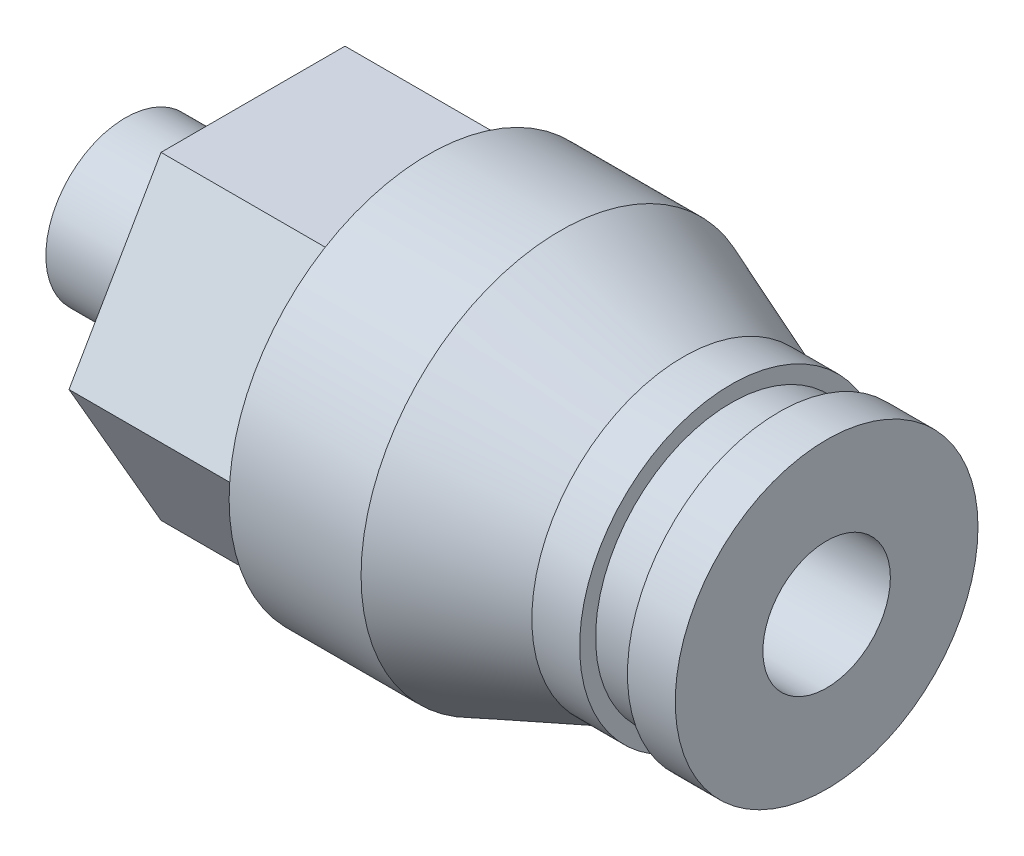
ISO-10303-21;
HEADER;
FILE_DESCRIPTION(('STEP AP214'),'2;1');
FILE_NAME('part.step','',(''),(''),'','','');
FILE_SCHEMA(('AUTOMOTIVE_DESIGN { 1 0 10303 214 1 1 1 1 }'));
ENDSEC;
DATA;
#1=APPLICATION_CONTEXT('core data for automotive mechanical design processes');
#2=APPLICATION_PROTOCOL_DEFINITION('international standard','automotive_design',2000,#1);
#3=PRODUCT_CONTEXT('',#1,'mechanical');
#4=PRODUCT('Part','Part','',(#3));
#5=PRODUCT_RELATED_PRODUCT_CATEGORY('part','',(#4));
#6=PRODUCT_DEFINITION_FORMATION('','',#4);
#7=PRODUCT_DEFINITION_CONTEXT('part definition',#1,'design');
#8=PRODUCT_DEFINITION('design','',#6,#7);
#9=PRODUCT_DEFINITION_SHAPE('','',#8);
#10=(LENGTH_UNIT() NAMED_UNIT(*) SI_UNIT(.MILLI.,.METRE.));
#11=(NAMED_UNIT(*) PLANE_ANGLE_UNIT() SI_UNIT($,.RADIAN.));
#12=(NAMED_UNIT(*) SI_UNIT($,.STERADIAN.) SOLID_ANGLE_UNIT());
#13=UNCERTAINTY_MEASURE_WITH_UNIT(LENGTH_MEASURE(1.E-05),#10,'distance_accuracy_value','');
#14=(GEOMETRIC_REPRESENTATION_CONTEXT(3) GLOBAL_UNCERTAINTY_ASSIGNED_CONTEXT((#13)) GLOBAL_UNIT_ASSIGNED_CONTEXT((#10,
#11,#12)) REPRESENTATION_CONTEXT('',''));
#15=CARTESIAN_POINT('',(0.,0.,0.));
#16=DIRECTION('',(0.,0.,1.));
#17=DIRECTION('',(1.,0.,0.));
#18=AXIS2_PLACEMENT_3D('',#15,#16,#17);
#19=CARTESIAN_POINT('',(4.,2.5,0.));
#20=DIRECTION('',(-1.,0.,0.));
#21=DIRECTION('',(0.,0.,1.));
#22=AXIS2_PLACEMENT_3D('',#19,#20,#21);
#23=PLANE('',#22);
#24=CARTESIAN_POINT('',(4.,0.,0.));
#25=DIRECTION('',(1.,0.,0.));
#26=DIRECTION('',(0.,0.,-1.));
#27=AXIS2_PLACEMENT_3D('',#24,#25,#26);
#28=CIRCLE('',#27,2.5);
#29=CARTESIAN_POINT('',(4.,0.,-2.5));
#30=VERTEX_POINT('',#29);
#31=EDGE_CURVE('E220',#30,#30,#28,.T.);
#32=ORIENTED_EDGE('',*,*,#31,.T.);
#33=EDGE_LOOP('',(#32));
#34=FACE_BOUND('',#33,.T.);
#35=DIRECTION('',(0.,-0.866025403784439,0.5));
#36=VECTOR('',#35,1.);
#37=CARTESIAN_POINT('',(4.,0.,-5.77350269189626));
#38=LINE('',#37,#36);
#39=CARTESIAN_POINT('',(4.,0.,-5.77350269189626));
#40=VERTEX_POINT('',#39);
#41=CARTESIAN_POINT('',(4.,-5.,-2.88675134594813));
#42=VERTEX_POINT('',#41);
#43=EDGE_CURVE('E129',#40,#42,#38,.T.);
#44=ORIENTED_EDGE('',*,*,#43,.T.);
#45=DIRECTION('',(0.,0.,1.));
#46=VECTOR('',#45,1.);
#47=CARTESIAN_POINT('',(4.,-5.,-2.88675134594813));
#48=LINE('',#47,#46);
#49=CARTESIAN_POINT('',(4.,-5.,2.88675134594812));
#50=VERTEX_POINT('',#49);
#51=EDGE_CURVE('E112',#42,#50,#48,.T.);
#52=ORIENTED_EDGE('',*,*,#51,.T.);
#53=DIRECTION('',(0.,0.866025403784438,0.5));
#54=VECTOR('',#53,1.);
#55=CARTESIAN_POINT('',(4.,-5.,2.88675134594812));
#56=LINE('',#55,#54);
#57=CARTESIAN_POINT('',(4.,0.,5.77350269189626));
#58=VERTEX_POINT('',#57);
#59=EDGE_CURVE('E123',#50,#58,#56,.T.);
#60=ORIENTED_EDGE('',*,*,#59,.T.);
#61=DIRECTION('',(0.,0.866025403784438,-0.5));
#62=VECTOR('',#61,1.);
#63=CARTESIAN_POINT('',(4.,0.,5.77350269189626));
#64=LINE('',#63,#62);
#65=CARTESIAN_POINT('',(4.,5.,2.88675134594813));
#66=VERTEX_POINT('',#65);
#67=EDGE_CURVE('E32',#58,#66,#64,.T.);
#68=ORIENTED_EDGE('',*,*,#67,.T.);
#69=DIRECTION('',(0.,0.,-1.));
#70=VECTOR('',#69,1.);
#71=CARTESIAN_POINT('',(4.,5.,2.88675134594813));
#72=LINE('',#71,#70);
#73=CARTESIAN_POINT('',(4.,5.,-2.88675134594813));
#74=VERTEX_POINT('',#73);
#75=EDGE_CURVE('E133',#66,#74,#72,.T.);
#76=ORIENTED_EDGE('',*,*,#75,.T.);
#77=DIRECTION('',(0.,-0.866025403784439,-0.5));
#78=VECTOR('',#77,1.);
#79=CARTESIAN_POINT('',(4.,5.,-2.88675134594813));
#80=LINE('',#79,#78);
#81=EDGE_CURVE('E136',#74,#40,#80,.T.);
#82=ORIENTED_EDGE('',*,*,#81,.T.);
#83=EDGE_LOOP('',(#44,#52,#60,#68,#76,#82));
#84=FACE_BOUND('',#83,.T.);
#85=ADVANCED_FACE('F17',(#34,#84),#23,.T.);
#86=CARTESIAN_POINT('',(0.,0.,0.));
#87=DIRECTION('',(-1.,0.,0.));
#88=DIRECTION('',(0.,0.,1.));
#89=AXIS2_PLACEMENT_3D('',#86,#87,#88);
#90=PLANE('',#89);
#91=CARTESIAN_POINT('',(0.,0.,0.));
#92=DIRECTION('',(1.,0.,0.));
#93=DIRECTION('',(0.,0.,-1.));
#94=AXIS2_PLACEMENT_3D('',#91,#92,#93);
#95=CIRCLE('',#94,2.5);
#96=CARTESIAN_POINT('',(0.,0.,-2.5));
#97=VERTEX_POINT('',#96);
#98=EDGE_CURVE('E223',#97,#97,#95,.T.);
#99=ORIENTED_EDGE('',*,*,#98,.F.);
#100=EDGE_LOOP('',(#99));
#101=FACE_BOUND('',#100,.T.);
#102=DIRECTION('',(0.,-0.866025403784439,-0.5));
#103=VECTOR('',#102,1.);
#104=CARTESIAN_POINT('',(0.,0.,1.15470053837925));
#105=LINE('',#104,#103);
#106=CARTESIAN_POINT('',(0.,0.,1.15470053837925));
#107=VERTEX_POINT('',#106);
#108=CARTESIAN_POINT('',(0.,-1.,0.577350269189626));
#109=VERTEX_POINT('',#108);
#110=EDGE_CURVE('E178',#107,#109,#105,.T.);
#111=ORIENTED_EDGE('',*,*,#110,.T.);
#112=DIRECTION('',(0.,0.,-1.));
#113=VECTOR('',#112,1.);
#114=CARTESIAN_POINT('',(0.,-1.,0.577350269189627));
#115=LINE('',#114,#113);
#116=CARTESIAN_POINT('',(0.,-1.,-0.577350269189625));
#117=VERTEX_POINT('',#116);
#118=EDGE_CURVE('E40',#109,#117,#115,.T.);
#119=ORIENTED_EDGE('',*,*,#118,.T.);
#120=DIRECTION('',(0.,0.866025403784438,-0.5));
#121=VECTOR('',#120,1.);
#122=CARTESIAN_POINT('',(0.,-1.,-0.577350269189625));
#123=LINE('',#122,#121);
#124=CARTESIAN_POINT('',(0.,0.,-1.15470053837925));
#125=VERTEX_POINT('',#124);
#126=EDGE_CURVE('E166',#117,#125,#123,.T.);
#127=ORIENTED_EDGE('',*,*,#126,.T.);
#128=DIRECTION('',(0.,0.866025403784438,0.5));
#129=VECTOR('',#128,1.);
#130=CARTESIAN_POINT('',(0.,0.,-1.15470053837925));
#131=LINE('',#130,#129);
#132=CARTESIAN_POINT('',(0.,1.,-0.577350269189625));
#133=VERTEX_POINT('',#132);
#134=EDGE_CURVE('E169',#125,#133,#131,.T.);
#135=ORIENTED_EDGE('',*,*,#134,.T.);
#136=DIRECTION('',(0.,0.,1.));
#137=VECTOR('',#136,1.);
#138=CARTESIAN_POINT('',(0.,1.,-0.577350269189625));
#139=LINE('',#138,#137);
#140=CARTESIAN_POINT('',(0.,1.,0.577350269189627));
#141=VERTEX_POINT('',#140);
#142=EDGE_CURVE('E172',#133,#141,#139,.T.);
#143=ORIENTED_EDGE('',*,*,#142,.T.);
#144=DIRECTION('',(0.,-0.866025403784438,0.5));
#145=VECTOR('',#144,1.);
#146=CARTESIAN_POINT('',(0.,1.,0.577350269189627));
#147=LINE('',#146,#145);
#148=EDGE_CURVE('E175',#141,#107,#147,.T.);
#149=ORIENTED_EDGE('',*,*,#148,.T.);
#150=EDGE_LOOP('',(#111,#119,#127,#135,#143,#149));
#151=FACE_BOUND('',#150,.T.);
#152=ADVANCED_FACE('F19',(#101,#151),#90,.T.);
#153=CARTESIAN_POINT('',(5.99999999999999,2.,0.));
#154=DIRECTION('',(1.,0.,0.));
#155=DIRECTION('',(0.,0.,-1.));
#156=AXIS2_PLACEMENT_3D('',#153,#154,#155);
#157=PLANE('',#156);
#158=CARTESIAN_POINT('',(5.99999999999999,0.,0.));
#159=DIRECTION('',(1.,0.,0.));
#160=DIRECTION('',(0.,0.,-1.));
#161=AXIS2_PLACEMENT_3D('',#158,#159,#160);
#162=CIRCLE('',#161,2.);
#163=CARTESIAN_POINT('',(5.99999999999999,0.,-2.));
#164=VERTEX_POINT('',#163);
#165=EDGE_CURVE('E193',#164,#164,#162,.T.);
#166=ORIENTED_EDGE('',*,*,#165,.T.);
#167=EDGE_LOOP('',(#166));
#168=FACE_BOUND('',#167,.T.);
#169=DIRECTION('',(0.,-0.866025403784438,0.5));
#170=VECTOR('',#169,1.);
#171=CARTESIAN_POINT('',(5.99999999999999,1.,-1.73205080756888));
#172=LINE('',#171,#170);
#173=CARTESIAN_POINT('',(5.99999999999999,0.,-1.15470053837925));
#174=VERTEX_POINT('',#173);
#175=CARTESIAN_POINT('',(5.99999999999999,-1.,-0.577350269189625));
#176=VERTEX_POINT('',#175);
#177=EDGE_CURVE('E25',#174,#176,#172,.T.);
#178=ORIENTED_EDGE('',*,*,#177,.T.);
#179=DIRECTION('',(0.,0.,1.));
#180=VECTOR('',#179,1.);
#181=CARTESIAN_POINT('',(5.99999999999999,-1.,0.));
#182=LINE('',#181,#180);
#183=CARTESIAN_POINT('',(5.99999999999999,-1.,0.577350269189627));
#184=VERTEX_POINT('',#183);
#185=EDGE_CURVE('E9',#176,#184,#182,.T.);
#186=ORIENTED_EDGE('',*,*,#185,.T.);
#187=DIRECTION('',(0.,0.866025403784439,0.5));
#188=VECTOR('',#187,1.);
#189=CARTESIAN_POINT('',(5.99999999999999,1.,1.73205080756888));
#190=LINE('',#189,#188);
#191=CARTESIAN_POINT('',(5.99999999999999,0.,1.15470053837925));
#192=VERTEX_POINT('',#191);
#193=EDGE_CURVE('E226',#184,#192,#190,.T.);
#194=ORIENTED_EDGE('',*,*,#193,.T.);
#195=DIRECTION('',(0.,0.866025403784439,-0.5));
#196=VECTOR('',#195,1.);
#197=CARTESIAN_POINT('',(5.99999999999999,2.,0.));
#198=LINE('',#197,#196);
#199=CARTESIAN_POINT('',(5.99999999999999,1.,0.577350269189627));
#200=VERTEX_POINT('',#199);
#201=EDGE_CURVE('E229',#192,#200,#198,.T.);
#202=ORIENTED_EDGE('',*,*,#201,.T.);
#203=DIRECTION('',(0.,0.,-1.));
#204=VECTOR('',#203,1.);
#205=CARTESIAN_POINT('',(5.99999999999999,1.,0.));
#206=LINE('',#205,#204);
#207=CARTESIAN_POINT('',(5.99999999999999,1.,-0.577350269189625));
#208=VERTEX_POINT('',#207);
#209=EDGE_CURVE('E232',#200,#208,#206,.T.);
#210=ORIENTED_EDGE('',*,*,#209,.T.);
#211=DIRECTION('',(0.,-0.866025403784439,-0.5));
#212=VECTOR('',#211,1.);
#213=CARTESIAN_POINT('',(5.99999999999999,2.,0.));
#214=LINE('',#213,#212);
#215=EDGE_CURVE('E235',#208,#174,#214,.T.);
#216=ORIENTED_EDGE('',*,*,#215,.T.);
#217=EDGE_LOOP('',(#178,#186,#194,#202,#210,#216));
#218=FACE_BOUND('',#217,.T.);
#219=ADVANCED_FACE('F239',(#168,#218),#157,.T.);
#220=CARTESIAN_POINT('',(0.,0.,0.));
#221=DIRECTION('',(1.,0.,0.));
#222=DIRECTION('',(0.,0.,-1.));
#223=AXIS2_PLACEMENT_3D('',#220,#221,#222);
#224=CYLINDRICAL_SURFACE('',#223,2.5);
#225=ORIENTED_EDGE('',*,*,#98,.T.);
#226=EDGE_LOOP('',(#225));
#227=FACE_BOUND('',#226,.T.);
#228=ORIENTED_EDGE('',*,*,#31,.F.);
#229=EDGE_LOOP('',(#228));
#230=FACE_BOUND('',#229,.T.);
#231=ADVANCED_FACE('F280',(#227,#230),#224,.T.);
#232=CARTESIAN_POINT('',(0.,0.,0.));
#233=DIRECTION('',(1.,0.,0.));
#234=DIRECTION('',(0.,0.,-1.));
#235=AXIS2_PLACEMENT_3D('',#232,#233,#234);
#236=CYLINDRICAL_SURFACE('',#235,6.24920521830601);
#237=CARTESIAN_POINT('',(9.5,0.,0.));
#238=DIRECTION('',(-1.,0.,0.));
#239=DIRECTION('',(0.,0.,1.));
#240=AXIS2_PLACEMENT_3D('',#237,#238,#239);
#241=CIRCLE('',#240,6.24920521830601);
#242=CARTESIAN_POINT('',(9.5,0.,6.24920521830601));
#243=VERTEX_POINT('',#242);
#244=EDGE_CURVE('E155',#243,#243,#241,.F.);
#245=ORIENTED_EDGE('',*,*,#244,.T.);
#246=EDGE_LOOP('',(#245));
#247=FACE_BOUND('',#246,.T.);
#248=CARTESIAN_POINT('',(13.6404760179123,0.,0.));
#249=DIRECTION('',(1.,0.,0.));
#250=DIRECTION('',(0.,0.,-1.));
#251=AXIS2_PLACEMENT_3D('',#248,#249,#250);
#252=CIRCLE('',#251,6.24920521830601);
#253=CARTESIAN_POINT('',(13.6404760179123,0.,-6.24920521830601));
#254=VERTEX_POINT('',#253);
#255=EDGE_CURVE('E217',#254,#254,#252,.T.);
#256=ORIENTED_EDGE('',*,*,#255,.F.);
#257=EDGE_LOOP('',(#256));
#258=FACE_BOUND('',#257,.T.);
#259=ADVANCED_FACE('F278',(#247,#258),#236,.T.);
#260=CARTESIAN_POINT('',(17.5,0.,0.));
#261=DIRECTION('',(-1.,0.,0.));
#262=DIRECTION('',(0.,0.,1.));
#263=AXIS2_PLACEMENT_3D('',#260,#261,#262);
#264=CONICAL_SURFACE('',#263,4.75,0.370503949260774);
#265=ORIENTED_EDGE('',*,*,#255,.T.);
#266=EDGE_LOOP('',(#265));
#267=FACE_BOUND('',#266,.T.);
#268=CARTESIAN_POINT('',(17.5,0.,0.));
#269=DIRECTION('',(1.,0.,0.));
#270=DIRECTION('',(0.,0.,-1.));
#271=AXIS2_PLACEMENT_3D('',#268,#269,#270);
#272=CIRCLE('',#271,4.75);
#273=CARTESIAN_POINT('',(17.5,0.,-4.75));
#274=VERTEX_POINT('',#273);
#275=EDGE_CURVE('E214',#274,#274,#272,.T.);
#276=ORIENTED_EDGE('',*,*,#275,.F.);
#277=EDGE_LOOP('',(#276));
#278=FACE_BOUND('',#277,.T.);
#279=ADVANCED_FACE('F287',(#267,#278),#264,.T.);
#280=CARTESIAN_POINT('',(0.,0.,0.));
#281=DIRECTION('',(1.,0.,0.));
#282=DIRECTION('',(0.,0.,-1.));
#283=AXIS2_PLACEMENT_3D('',#280,#281,#282);
#284=CYLINDRICAL_SURFACE('',#283,4.75);
#285=ORIENTED_EDGE('',*,*,#275,.T.);
#286=EDGE_LOOP('',(#285));
#287=FACE_BOUND('',#286,.T.);
#288=CARTESIAN_POINT('',(19.,0.,0.));
#289=DIRECTION('',(1.,0.,0.));
#290=DIRECTION('',(0.,0.,-1.));
#291=AXIS2_PLACEMENT_3D('',#288,#289,#290);
#292=CIRCLE('',#291,4.75);
#293=CARTESIAN_POINT('',(19.,0.,-4.75));
#294=VERTEX_POINT('',#293);
#295=EDGE_CURVE('E211',#294,#294,#292,.T.);
#296=ORIENTED_EDGE('',*,*,#295,.F.);
#297=EDGE_LOOP('',(#296));
#298=FACE_BOUND('',#297,.T.);
#299=ADVANCED_FACE('F314',(#287,#298),#284,.T.);
#300=CARTESIAN_POINT('',(19.,4.75,0.));
#301=DIRECTION('',(1.,0.,0.));
#302=DIRECTION('',(0.,0.,-1.));
#303=AXIS2_PLACEMENT_3D('',#300,#301,#302);
#304=PLANE('',#303);
#305=ORIENTED_EDGE('',*,*,#295,.T.);
#306=EDGE_LOOP('',(#305));
#307=FACE_BOUND('',#306,.T.);
#308=CARTESIAN_POINT('',(19.,0.,0.));
#309=DIRECTION('',(1.,0.,0.));
#310=DIRECTION('',(0.,0.,-1.));
#311=AXIS2_PLACEMENT_3D('',#308,#309,#310);
#312=CIRCLE('',#311,4.25);
#313=CARTESIAN_POINT('',(19.,0.,-4.25));
#314=VERTEX_POINT('',#313);
#315=EDGE_CURVE('E208',#314,#314,#312,.T.);
#316=ORIENTED_EDGE('',*,*,#315,.F.);
#317=EDGE_LOOP('',(#316));
#318=FACE_BOUND('',#317,.T.);
#319=ADVANCED_FACE('F310',(#307,#318),#304,.T.);
#320=CARTESIAN_POINT('',(0.,0.,0.));
#321=DIRECTION('',(1.,0.,0.));
#322=DIRECTION('',(0.,0.,-1.));
#323=AXIS2_PLACEMENT_3D('',#320,#321,#322);
#324=CYLINDRICAL_SURFACE('',#323,4.25);
#325=ORIENTED_EDGE('',*,*,#315,.T.);
#326=EDGE_LOOP('',(#325));
#327=FACE_BOUND('',#326,.T.);
#328=CARTESIAN_POINT('',(20.5,0.,0.));
#329=DIRECTION('',(1.,0.,0.));
#330=DIRECTION('',(0.,0.,-1.));
#331=AXIS2_PLACEMENT_3D('',#328,#329,#330);
#332=CIRCLE('',#331,4.25);
#333=CARTESIAN_POINT('',(20.5,0.,-4.25));
#334=VERTEX_POINT('',#333);
#335=EDGE_CURVE('E205',#334,#334,#332,.T.);
#336=ORIENTED_EDGE('',*,*,#335,.F.);
#337=EDGE_LOOP('',(#336));
#338=FACE_BOUND('',#337,.T.);
#339=ADVANCED_FACE('F306',(#327,#338),#324,.T.);
#340=CARTESIAN_POINT('',(20.5,4.25,0.));
#341=DIRECTION('',(-1.,0.,0.));
#342=DIRECTION('',(0.,0.,1.));
#343=AXIS2_PLACEMENT_3D('',#340,#341,#342);
#344=PLANE('',#343);
#345=ORIENTED_EDGE('',*,*,#335,.T.);
#346=EDGE_LOOP('',(#345));
#347=FACE_BOUND('',#346,.T.);
#348=CARTESIAN_POINT('',(20.5,0.,0.));
#349=DIRECTION('',(1.,0.,0.));
#350=DIRECTION('',(0.,0.,-1.));
#351=AXIS2_PLACEMENT_3D('',#348,#349,#350);
#352=CIRCLE('',#351,4.75);
#353=CARTESIAN_POINT('',(20.5,0.,-4.75));
#354=VERTEX_POINT('',#353);
#355=EDGE_CURVE('E202',#354,#354,#352,.T.);
#356=ORIENTED_EDGE('',*,*,#355,.F.);
#357=EDGE_LOOP('',(#356));
#358=FACE_BOUND('',#357,.T.);
#359=ADVANCED_FACE('F302',(#347,#358),#344,.T.);
#360=CARTESIAN_POINT('',(0.,0.,0.));
#361=DIRECTION('',(1.,0.,0.));
#362=DIRECTION('',(0.,0.,-1.));
#363=AXIS2_PLACEMENT_3D('',#360,#361,#362);
#364=CYLINDRICAL_SURFACE('',#363,4.75);
#365=ORIENTED_EDGE('',*,*,#355,.T.);
#366=EDGE_LOOP('',(#365));
#367=FACE_BOUND('',#366,.T.);
#368=CARTESIAN_POINT('',(22.,0.,0.));
#369=DIRECTION('',(1.,0.,0.));
#370=DIRECTION('',(0.,0.,-1.));
#371=AXIS2_PLACEMENT_3D('',#368,#369,#370);
#372=CIRCLE('',#371,4.75);
#373=CARTESIAN_POINT('',(22.,0.,-4.75));
#374=VERTEX_POINT('',#373);
#375=EDGE_CURVE('E199',#374,#374,#372,.T.);
#376=ORIENTED_EDGE('',*,*,#375,.F.);
#377=EDGE_LOOP('',(#376));
#378=FACE_BOUND('',#377,.T.);
#379=ADVANCED_FACE('F298',(#367,#378),#364,.T.);
#380=CARTESIAN_POINT('',(22.,4.75,0.));
#381=DIRECTION('',(1.,0.,0.));
#382=DIRECTION('',(0.,0.,-1.));
#383=AXIS2_PLACEMENT_3D('',#380,#381,#382);
#384=PLANE('',#383);
#385=ORIENTED_EDGE('',*,*,#375,.T.);
#386=EDGE_LOOP('',(#385));
#387=FACE_BOUND('',#386,.T.);
#388=CARTESIAN_POINT('',(22.,0.,0.));
#389=DIRECTION('',(1.,0.,0.));
#390=DIRECTION('',(0.,0.,-1.));
#391=AXIS2_PLACEMENT_3D('',#388,#389,#390);
#392=CIRCLE('',#391,2.);
#393=CARTESIAN_POINT('',(22.,0.,-2.));
#394=VERTEX_POINT('',#393);
#395=EDGE_CURVE('E196',#394,#394,#392,.T.);
#396=ORIENTED_EDGE('',*,*,#395,.F.);
#397=EDGE_LOOP('',(#396));
#398=FACE_BOUND('',#397,.T.);
#399=ADVANCED_FACE('F266',(#387,#398),#384,.T.);
#400=CARTESIAN_POINT('',(0.,0.,0.));
#401=DIRECTION('',(1.,0.,0.));
#402=DIRECTION('',(0.,0.,-1.));
#403=AXIS2_PLACEMENT_3D('',#400,#401,#402);
#404=CYLINDRICAL_SURFACE('',#403,2.);
#405=ORIENTED_EDGE('',*,*,#395,.T.);
#406=EDGE_LOOP('',(#405));
#407=FACE_BOUND('',#406,.T.);
#408=ORIENTED_EDGE('',*,*,#165,.F.);
#409=EDGE_LOOP('',(#408));
#410=FACE_BOUND('',#409,.T.);
#411=ADVANCED_FACE('F258',(#407,#410),#404,.F.);
#412=CARTESIAN_POINT('',(22.,-1.,0.577350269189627));
#413=DIRECTION('',(0.,1.,0.));
#414=DIRECTION('',(0.,0.,1.));
#415=AXIS2_PLACEMENT_3D('',#412,#413,#414);
#416=PLANE('',#415);
#417=DIRECTION('',(-1.,0.,0.));
#418=VECTOR('',#417,1.);
#419=CARTESIAN_POINT('',(22.,-1.,-0.577350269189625));
#420=LINE('',#419,#418);
#421=EDGE_CURVE('E191',#176,#117,#420,.T.);
#422=ORIENTED_EDGE('',*,*,#421,.T.);
#423=ORIENTED_EDGE('',*,*,#118,.F.);
#424=DIRECTION('',(-1.,0.,0.));
#425=VECTOR('',#424,1.);
#426=CARTESIAN_POINT('',(22.,-1.,0.577350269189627));
#427=LINE('',#426,#425);
#428=EDGE_CURVE('E181',#184,#109,#427,.T.);
#429=ORIENTED_EDGE('',*,*,#428,.F.);
#430=ORIENTED_EDGE('',*,*,#185,.F.);
#431=EDGE_LOOP('',(#422,#423,#429,#430));
#432=FACE_BOUND('',#431,.T.);
#433=ADVANCED_FACE('F256',(#432),#416,.T.);
#434=CARTESIAN_POINT('',(22.,-1.,-0.577350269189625));
#435=DIRECTION('',(0.,0.5,0.866025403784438));
#436=DIRECTION('',(0.,-0.866025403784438,0.5));
#437=AXIS2_PLACEMENT_3D('',#434,#435,#436);
#438=PLANE('',#437);
#439=DIRECTION('',(-1.,0.,0.));
#440=VECTOR('',#439,1.);
#441=CARTESIAN_POINT('',(22.,0.,-1.15470053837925));
#442=LINE('',#441,#440);
#443=EDGE_CURVE('E189',#174,#125,#442,.T.);
#444=ORIENTED_EDGE('',*,*,#443,.T.);
#445=ORIENTED_EDGE('',*,*,#126,.F.);
#446=ORIENTED_EDGE('',*,*,#421,.F.);
#447=ORIENTED_EDGE('',*,*,#177,.F.);
#448=EDGE_LOOP('',(#444,#445,#446,#447));
#449=FACE_BOUND('',#448,.T.);
#450=ADVANCED_FACE('F243',(#449),#438,.T.);
#451=CARTESIAN_POINT('',(22.,0.,-1.15470053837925));
#452=DIRECTION('',(0.,-0.5,0.866025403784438));
#453=DIRECTION('',(0.,-0.866025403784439,-0.5));
#454=AXIS2_PLACEMENT_3D('',#451,#452,#453);
#455=PLANE('',#454);
#456=DIRECTION('',(-1.,0.,0.));
#457=VECTOR('',#456,1.);
#458=CARTESIAN_POINT('',(22.,1.,-0.577350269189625));
#459=LINE('',#458,#457);
#460=EDGE_CURVE('E187',#208,#133,#459,.T.);
#461=ORIENTED_EDGE('',*,*,#460,.T.);
#462=ORIENTED_EDGE('',*,*,#134,.F.);
#463=ORIENTED_EDGE('',*,*,#443,.F.);
#464=ORIENTED_EDGE('',*,*,#215,.F.);
#465=EDGE_LOOP('',(#461,#462,#463,#464));
#466=FACE_BOUND('',#465,.T.);
#467=ADVANCED_FACE('F247',(#466),#455,.T.);
#468=CARTESIAN_POINT('',(22.,1.,-0.577350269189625));
#469=DIRECTION('',(0.,-1.,0.));
#470=DIRECTION('',(0.,0.,-1.));
#471=AXIS2_PLACEMENT_3D('',#468,#469,#470);
#472=PLANE('',#471);
#473=DIRECTION('',(-1.,0.,0.));
#474=VECTOR('',#473,1.);
#475=CARTESIAN_POINT('',(22.,1.,0.577350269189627));
#476=LINE('',#475,#474);
#477=EDGE_CURVE('E185',#200,#141,#476,.T.);
#478=ORIENTED_EDGE('',*,*,#477,.T.);
#479=ORIENTED_EDGE('',*,*,#142,.F.);
#480=ORIENTED_EDGE('',*,*,#460,.F.);
#481=ORIENTED_EDGE('',*,*,#209,.F.);
#482=EDGE_LOOP('',(#478,#479,#480,#481));
#483=FACE_BOUND('',#482,.T.);
#484=ADVANCED_FACE('F404',(#483),#472,.T.);
#485=CARTESIAN_POINT('',(22.,1.,0.577350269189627));
#486=DIRECTION('',(0.,-0.5,-0.866025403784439));
#487=DIRECTION('',(0.,0.866025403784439,-0.5));
#488=AXIS2_PLACEMENT_3D('',#485,#486,#487);
#489=PLANE('',#488);
#490=DIRECTION('',(-1.,0.,0.));
#491=VECTOR('',#490,1.);
#492=CARTESIAN_POINT('',(22.,0.,1.15470053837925));
#493=LINE('',#492,#491);
#494=EDGE_CURVE('E183',#192,#107,#493,.T.);
#495=ORIENTED_EDGE('',*,*,#494,.T.);
#496=ORIENTED_EDGE('',*,*,#148,.F.);
#497=ORIENTED_EDGE('',*,*,#477,.F.);
#498=ORIENTED_EDGE('',*,*,#201,.F.);
#499=EDGE_LOOP('',(#495,#496,#497,#498));
#500=FACE_BOUND('',#499,.T.);
#501=ADVANCED_FACE('F413',(#500),#489,.T.);
#502=CARTESIAN_POINT('',(22.,0.,1.15470053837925));
#503=DIRECTION('',(0.,0.5,-0.866025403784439));
#504=DIRECTION('',(0.,0.866025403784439,0.5));
#505=AXIS2_PLACEMENT_3D('',#502,#503,#504);
#506=PLANE('',#505);
#507=ORIENTED_EDGE('',*,*,#428,.T.);
#508=ORIENTED_EDGE('',*,*,#110,.F.);
#509=ORIENTED_EDGE('',*,*,#494,.F.);
#510=ORIENTED_EDGE('',*,*,#193,.F.);
#511=EDGE_LOOP('',(#507,#508,#509,#510));
#512=FACE_BOUND('',#511,.T.);
#513=ADVANCED_FACE('F254',(#512),#506,.T.);
#514=CARTESIAN_POINT('',(9.5,0.,0.));
#515=DIRECTION('',(-1.,0.,0.));
#516=DIRECTION('',(0.,0.,1.));
#517=AXIS2_PLACEMENT_3D('',#514,#515,#516);
#518=PLANE('',#517);
#519=ORIENTED_EDGE('',*,*,#244,.F.);
#520=EDGE_LOOP('',(#519));
#521=FACE_BOUND('',#520,.T.);
#522=DIRECTION('',(0.,-0.866025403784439,0.5));
#523=VECTOR('',#522,1.);
#524=CARTESIAN_POINT('',(9.5,0.,-5.77350269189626));
#525=LINE('',#524,#523);
#526=CARTESIAN_POINT('',(9.5,0.,-5.77350269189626));
#527=VERTEX_POINT('',#526);
#528=CARTESIAN_POINT('',(9.5,-5.,-2.88675134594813));
#529=VERTEX_POINT('',#528);
#530=EDGE_CURVE('E120',#527,#529,#525,.T.);
#531=ORIENTED_EDGE('',*,*,#530,.F.);
#532=DIRECTION('',(0.,-0.866025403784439,-0.5));
#533=VECTOR('',#532,1.);
#534=CARTESIAN_POINT('',(9.5,5.,-2.88675134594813));
#535=LINE('',#534,#533);
#536=CARTESIAN_POINT('',(9.5,5.,-2.88675134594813));
#537=VERTEX_POINT('',#536);
#538=EDGE_CURVE('E148',#537,#527,#535,.T.);
#539=ORIENTED_EDGE('',*,*,#538,.F.);
#540=DIRECTION('',(0.,0.,-1.));
#541=VECTOR('',#540,1.);
#542=CARTESIAN_POINT('',(9.5,5.,2.88675134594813));
#543=LINE('',#542,#541);
#544=CARTESIAN_POINT('',(9.5,5.,2.88675134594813));
#545=VERTEX_POINT('',#544);
#546=EDGE_CURVE('E145',#545,#537,#543,.T.);
#547=ORIENTED_EDGE('',*,*,#546,.F.);
#548=DIRECTION('',(0.,0.866025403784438,-0.5));
#549=VECTOR('',#548,1.);
#550=CARTESIAN_POINT('',(9.5,0.,5.77350269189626));
#551=LINE('',#550,#549);
#552=CARTESIAN_POINT('',(9.5,0.,5.77350269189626));
#553=VERTEX_POINT('',#552);
#554=EDGE_CURVE('E142',#553,#545,#551,.T.);
#555=ORIENTED_EDGE('',*,*,#554,.F.);
#556=DIRECTION('',(0.,0.866025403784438,0.5));
#557=VECTOR('',#556,1.);
#558=CARTESIAN_POINT('',(9.5,-5.,2.88675134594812));
#559=LINE('',#558,#557);
#560=CARTESIAN_POINT('',(9.5,-5.,2.88675134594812));
#561=VERTEX_POINT('',#560);
#562=EDGE_CURVE('E140',#561,#553,#559,.T.);
#563=ORIENTED_EDGE('',*,*,#562,.F.);
#564=DIRECTION('',(0.,0.,1.));
#565=VECTOR('',#564,1.);
#566=CARTESIAN_POINT('',(9.5,-5.,-2.88675134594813));
#567=LINE('',#566,#565);
#568=EDGE_CURVE('E115',#529,#561,#567,.T.);
#569=ORIENTED_EDGE('',*,*,#568,.F.);
#570=EDGE_LOOP('',(#531,#539,#547,#555,#563,#569));
#571=FACE_BOUND('',#570,.T.);
#572=ADVANCED_FACE('F432',(#521,#571),#518,.T.);
#573=CARTESIAN_POINT('',(9.5,-5.,-2.88675134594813));
#574=DIRECTION('',(0.,-1.,0.));
#575=DIRECTION('',(0.,0.,-1.));
#576=AXIS2_PLACEMENT_3D('',#573,#574,#575);
#577=PLANE('',#576);
#578=DIRECTION('',(-1.,0.,0.));
#579=VECTOR('',#578,1.);
#580=CARTESIAN_POINT('',(9.5,-5.,-2.88675134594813));
#581=LINE('',#580,#579);
#582=EDGE_CURVE('E153',#529,#42,#581,.T.);
#583=ORIENTED_EDGE('',*,*,#582,.F.);
#584=ORIENTED_EDGE('',*,*,#568,.T.);
#585=DIRECTION('',(-1.,0.,0.));
#586=VECTOR('',#585,1.);
#587=CARTESIAN_POINT('',(9.5,-5.,2.88675134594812));
#588=LINE('',#587,#586);
#589=EDGE_CURVE('E108',#561,#50,#588,.T.);
#590=ORIENTED_EDGE('',*,*,#589,.T.);
#591=ORIENTED_EDGE('',*,*,#51,.F.);
#592=EDGE_LOOP('',(#583,#584,#590,#591));
#593=FACE_BOUND('',#592,.T.);
#594=ADVANCED_FACE('F110',(#593),#577,.T.);
#595=CARTESIAN_POINT('',(9.5,0.,-5.77350269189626));
#596=DIRECTION('',(0.,-0.5,-0.866025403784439));
#597=DIRECTION('',(0.,0.866025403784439,-0.5));
#598=AXIS2_PLACEMENT_3D('',#595,#596,#597);
#599=PLANE('',#598);
#600=DIRECTION('',(-1.,0.,0.));
#601=VECTOR('',#600,1.);
#602=CARTESIAN_POINT('',(9.5,0.,-5.77350269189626));
#603=LINE('',#602,#601);
#604=EDGE_CURVE('E156',#527,#40,#603,.T.);
#605=ORIENTED_EDGE('',*,*,#604,.F.);
#606=ORIENTED_EDGE('',*,*,#530,.T.);
#607=ORIENTED_EDGE('',*,*,#582,.T.);
#608=ORIENTED_EDGE('',*,*,#43,.F.);
#609=EDGE_LOOP('',(#605,#606,#607,#608));
#610=FACE_BOUND('',#609,.T.);
#611=ADVANCED_FACE('F450',(#610),#599,.T.);
#612=CARTESIAN_POINT('',(9.5,5.,-2.88675134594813));
#613=DIRECTION('',(0.,0.5,-0.866025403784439));
#614=DIRECTION('',(0.,0.866025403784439,0.5));
#615=AXIS2_PLACEMENT_3D('',#612,#613,#614);
#616=PLANE('',#615);
#617=DIRECTION('',(-1.,0.,0.));
#618=VECTOR('',#617,1.);
#619=CARTESIAN_POINT('',(9.5,5.,-2.88675134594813));
#620=LINE('',#619,#618);
#621=EDGE_CURVE('E158',#537,#74,#620,.T.);
#622=ORIENTED_EDGE('',*,*,#621,.F.);
#623=ORIENTED_EDGE('',*,*,#538,.T.);
#624=ORIENTED_EDGE('',*,*,#604,.T.);
#625=ORIENTED_EDGE('',*,*,#81,.F.);
#626=EDGE_LOOP('',(#622,#623,#624,#625));
#627=FACE_BOUND('',#626,.T.);
#628=ADVANCED_FACE('F459',(#627),#616,.T.);
#629=CARTESIAN_POINT('',(9.5,5.,2.88675134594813));
#630=DIRECTION('',(0.,1.,0.));
#631=DIRECTION('',(0.,0.,1.));
#632=AXIS2_PLACEMENT_3D('',#629,#630,#631);
#633=PLANE('',#632);
#634=DIRECTION('',(-1.,0.,0.));
#635=VECTOR('',#634,1.);
#636=CARTESIAN_POINT('',(9.5,5.,2.88675134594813));
#637=LINE('',#636,#635);
#638=EDGE_CURVE('E160',#545,#66,#637,.T.);
#639=ORIENTED_EDGE('',*,*,#638,.F.);
#640=ORIENTED_EDGE('',*,*,#546,.T.);
#641=ORIENTED_EDGE('',*,*,#621,.T.);
#642=ORIENTED_EDGE('',*,*,#75,.F.);
#643=EDGE_LOOP('',(#639,#640,#641,#642));
#644=FACE_BOUND('',#643,.T.);
#645=ADVANCED_FACE('F469',(#644),#633,.T.);
#646=CARTESIAN_POINT('',(9.5,0.,5.77350269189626));
#647=DIRECTION('',(0.,0.5,0.866025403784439));
#648=DIRECTION('',(0.,-0.866025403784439,0.5));
#649=AXIS2_PLACEMENT_3D('',#646,#647,#648);
#650=PLANE('',#649);
#651=DIRECTION('',(-1.,0.,0.));
#652=VECTOR('',#651,1.);
#653=CARTESIAN_POINT('',(9.5,0.,5.77350269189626));
#654=LINE('',#653,#652);
#655=EDGE_CURVE('E119',#553,#58,#654,.T.);
#656=ORIENTED_EDGE('',*,*,#655,.F.);
#657=ORIENTED_EDGE('',*,*,#554,.T.);
#658=ORIENTED_EDGE('',*,*,#638,.T.);
#659=ORIENTED_EDGE('',*,*,#67,.F.);
#660=EDGE_LOOP('',(#656,#657,#658,#659));
#661=FACE_BOUND('',#660,.T.);
#662=ADVANCED_FACE('F479',(#661),#650,.T.);
#663=CARTESIAN_POINT('',(9.5,-5.,2.88675134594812));
#664=DIRECTION('',(0.,-0.5,0.866025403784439));
#665=DIRECTION('',(0.,-0.866025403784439,-0.5));
#666=AXIS2_PLACEMENT_3D('',#663,#664,#665);
#667=PLANE('',#666);
#668=ORIENTED_EDGE('',*,*,#589,.F.);
#669=ORIENTED_EDGE('',*,*,#562,.T.);
#670=ORIENTED_EDGE('',*,*,#655,.T.);
#671=ORIENTED_EDGE('',*,*,#59,.F.);
#672=EDGE_LOOP('',(#668,#669,#670,#671));
#673=FACE_BOUND('',#672,.T.);
#674=ADVANCED_FACE('F124',(#673),#667,.T.);
#675=CLOSED_SHELL('',(#85,#152,#219,#231,#259,#279,#299,#319,#339,#359,#379,#399,#411,#433,#450,
#467,#484,#501,#513,#572,#594,#611,#628,#645,#662,#674));
#676=MANIFOLD_SOLID_BREP('B1',#675);
#677=ADVANCED_BREP_SHAPE_REPRESENTATION('',(#18,#676),#14);
#678=SHAPE_DEFINITION_REPRESENTATION(#9,#677);
ENDSEC;
END-ISO-10303-21;
